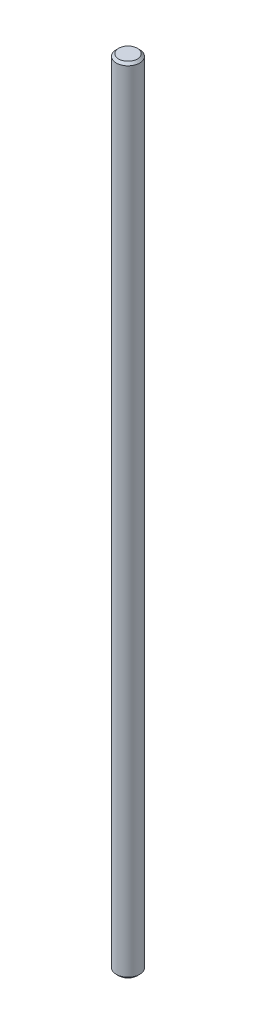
from build123d import *

# Parameters (mm, degrees)
SKETCH1_R      = 2
EXTRUDE1_DEPTH = 136
CHAMFER1_SIZE  = 0.4


with BuildPart() as part:
    # Sketch1 → Extrude1 (new body)
    with BuildSketch(Plane(origin=(0, 0, 0), x_dir=(1, 0, 0), z_dir=(0, 1, 0))):
        with Locations(Location((0, 0, 0), (0, 0, 270))):
            Circle(SKETCH1_R)
    extrude(amount=EXTRUDE1_DEPTH)

    # Chamfer1
    chamfer1_edges = [part.edges().sort_by_distance(p)[0] for p in [
        (0, 0, -2),
        (0, 136, -2),
    ]]
    chamfer(chamfer1_edges, length=CHAMFER1_SIZE)


solid = part.part
